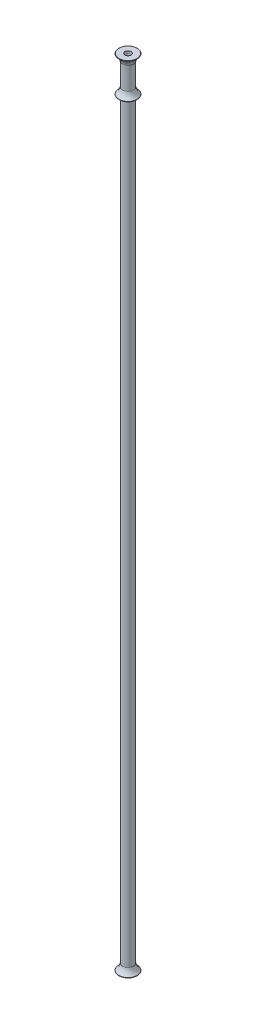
from build123d import *


with BuildPart() as part:
    # Esquisse1 → R_volution1 (revolve)
    with BuildSketch(Plane.XY, mode=Mode.PRIVATE) as r_volution1_sk:
        with BuildLine():
            Line((6, 0), (17.5, 0))
            ThreePointArc((17.5, 0), (17.971000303, 0.332194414), (17.816145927, 0.887365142))
            ThreePointArc((17.816145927, 0.887365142), (13.186679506, 6.304079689), (10.75, 13))
            Line((10.75, 13), (10.75, 1490))
            Line((10.75, 1490), (17.5, 1490))
            ThreePointArc((17.5, 1490), (17.971000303, 1490.332194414), (17.816145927, 1490.887365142))
            ThreePointArc((17.816145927, 1490.887365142), (13.186679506, 1496.304079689), (10.75, 1503))
            Line((10.75, 1503), (10.75, 1547))
            ThreePointArc((10.75, 1547), (13.186679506, 1553.695920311), (17.816145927, 1559.112634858))
            ThreePointArc((17.816145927, 1559.112634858), (17.971000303, 1559.667805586), (17.5, 1560))
            Line((17.5, 1560), (6, 1560))
            Line((6, 1560), (6, 0))
        make_face()
    revolve(r_volution1_sk.sketch.rotate(Axis((0, 0, 0), (0, 1, 0)), 90), axis=Axis((0, 0, 0), (0, 1, 0)))


solid = part.part
